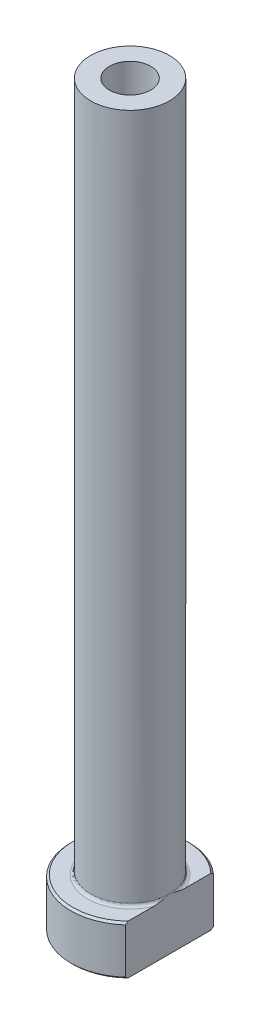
ISO-10303-21;
HEADER;
FILE_DESCRIPTION(('STEP AP214'),'2;1');
FILE_NAME('part.step','',(''),(''),'','','');
FILE_SCHEMA(('AUTOMOTIVE_DESIGN { 1 0 10303 214 1 1 1 1 }'));
ENDSEC;
DATA;
#1=APPLICATION_CONTEXT('core data for automotive mechanical design processes');
#2=APPLICATION_PROTOCOL_DEFINITION('international standard','automotive_design',2000,#1);
#3=PRODUCT_CONTEXT('',#1,'mechanical');
#4=PRODUCT('Part','Part','',(#3));
#5=PRODUCT_RELATED_PRODUCT_CATEGORY('part','',(#4));
#6=PRODUCT_DEFINITION_FORMATION('','',#4);
#7=PRODUCT_DEFINITION_CONTEXT('part definition',#1,'design');
#8=PRODUCT_DEFINITION('design','',#6,#7);
#9=PRODUCT_DEFINITION_SHAPE('','',#8);
#10=(LENGTH_UNIT() NAMED_UNIT(*) SI_UNIT(.MILLI.,.METRE.));
#11=(NAMED_UNIT(*) PLANE_ANGLE_UNIT() SI_UNIT($,.RADIAN.));
#12=(NAMED_UNIT(*) SI_UNIT($,.STERADIAN.) SOLID_ANGLE_UNIT());
#13=UNCERTAINTY_MEASURE_WITH_UNIT(LENGTH_MEASURE(1.E-05),#10,'distance_accuracy_value','');
#14=(GEOMETRIC_REPRESENTATION_CONTEXT(3) GLOBAL_UNCERTAINTY_ASSIGNED_CONTEXT((#13)) GLOBAL_UNIT_ASSIGNED_CONTEXT((#10,
#11,#12)) REPRESENTATION_CONTEXT('',''));
#15=CARTESIAN_POINT('',(0.,0.,0.));
#16=DIRECTION('',(0.,0.,1.));
#17=DIRECTION('',(1.,0.,0.));
#18=AXIS2_PLACEMENT_3D('',#15,#16,#17);
#19=CARTESIAN_POINT('',(0.,92.1876809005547,0.));
#20=DIRECTION('',(0.,1.,0.));
#21=DIRECTION('',(0.,0.,1.));
#22=AXIS2_PLACEMENT_3D('',#19,#20,#21);
#23=CYLINDRICAL_SURFACE('',#22,2.10000000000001);
#24=CARTESIAN_POINT('',(0.,75.,0.));
#25=DIRECTION('',(0.,1.,0.));
#26=DIRECTION('',(0.,0.,1.));
#27=AXIS2_PLACEMENT_3D('',#24,#25,#26);
#28=CIRCLE('',#27,2.10000000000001);
#29=CARTESIAN_POINT('',(0.,75.,2.10000000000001));
#30=VERTEX_POINT('',#29);
#31=EDGE_CURVE('E167',#30,#30,#28,.T.);
#32=ORIENTED_EDGE('',*,*,#31,.T.);
#33=EDGE_LOOP('',(#32));
#34=FACE_BOUND('',#33,.T.);
#35=CARTESIAN_POINT('',(0.,30.,0.));
#36=DIRECTION('',(0.,1.,0.));
#37=DIRECTION('',(0.,0.,1.));
#38=AXIS2_PLACEMENT_3D('',#35,#36,#37);
#39=CIRCLE('',#38,2.10000000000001);
#40=CARTESIAN_POINT('',(0.,30.,2.10000000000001));
#41=VERTEX_POINT('',#40);
#42=EDGE_CURVE('E170',#41,#41,#39,.T.);
#43=ORIENTED_EDGE('',*,*,#42,.F.);
#44=EDGE_LOOP('',(#43));
#45=FACE_BOUND('',#44,.T.);
#46=ADVANCED_FACE('F32',(#34,#45),#23,.F.);
#47=CARTESIAN_POINT('',(-2.10000000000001,75.,0.));
#48=DIRECTION('',(0.,1.,0.));
#49=DIRECTION('',(0.,0.,1.));
#50=AXIS2_PLACEMENT_3D('',#47,#48,#49);
#51=PLANE('',#50);
#52=CARTESIAN_POINT('',(0.,75.,0.));
#53=DIRECTION('',(0.,1.,0.));
#54=DIRECTION('',(0.,0.,1.));
#55=AXIS2_PLACEMENT_3D('',#52,#53,#54);
#56=CIRCLE('',#55,4.);
#57=CARTESIAN_POINT('',(0.,75.,4.));
#58=VERTEX_POINT('',#57);
#59=EDGE_CURVE('E174',#58,#58,#56,.T.);
#60=ORIENTED_EDGE('',*,*,#59,.T.);
#61=EDGE_LOOP('',(#60));
#62=FACE_BOUND('',#61,.T.);
#63=ORIENTED_EDGE('',*,*,#31,.F.);
#64=EDGE_LOOP('',(#63));
#65=FACE_BOUND('',#64,.T.);
#66=ADVANCED_FACE('F157',(#62,#65),#51,.T.);
#67=CARTESIAN_POINT('',(0.,92.1876809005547,0.));
#68=DIRECTION('',(0.,1.,0.));
#69=DIRECTION('',(0.,0.,1.));
#70=AXIS2_PLACEMENT_3D('',#67,#68,#69);
#71=CYLINDRICAL_SURFACE('',#70,3.99999999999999);
#72=CARTESIAN_POINT('',(0.,5.3,0.));
#73=DIRECTION('',(0.,1.,0.));
#74=DIRECTION('',(0.,0.,1.));
#75=AXIS2_PLACEMENT_3D('',#72,#73,#74);
#76=CIRCLE('',#75,3.99999999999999);
#77=CARTESIAN_POINT('',(4.,5.3,0.));
#78=VERTEX_POINT('',#77);
#79=EDGE_CURVE('E180',#78,#78,#76,.T.);
#80=ORIENTED_EDGE('',*,*,#79,.T.);
#81=EDGE_LOOP('',(#80));
#82=FACE_BOUND('',#81,.T.);
#83=ORIENTED_EDGE('',*,*,#59,.F.);
#84=EDGE_LOOP('',(#83));
#85=FACE_BOUND('',#84,.T.);
#86=ADVANCED_FACE('F162',(#82,#85),#71,.T.);
#87=CARTESIAN_POINT('',(-3.99999999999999,5.,0.));
#88=DIRECTION('',(0.,1.,0.));
#89=DIRECTION('',(0.,0.,1.));
#90=AXIS2_PLACEMENT_3D('',#87,#88,#89);
#91=PLANE('',#90);
#92=DIRECTION('',(0.,0.,1.));
#93=VECTOR('',#92,1.);
#94=CARTESIAN_POINT('',(4.,5.,0.));
#95=LINE('',#94,#93);
#96=CARTESIAN_POINT('',(4.,5.,-4.19999999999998));
#97=VERTEX_POINT('',#96);
#98=CARTESIAN_POINT('',(4.,5.,-1.57797338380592));
#99=VERTEX_POINT('',#98);
#100=EDGE_CURVE('E54',#97,#99,#95,.T.);
#101=ORIENTED_EDGE('',*,*,#100,.F.);
#102=CARTESIAN_POINT('',(0.,5.,0.));
#103=DIRECTION('',(0.,1.,0.));
#104=DIRECTION('',(0.,0.,1.));
#105=AXIS2_PLACEMENT_3D('',#102,#103,#104);
#106=CIRCLE('',#105,5.79999999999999);
#107=CARTESIAN_POINT('',(4.,5.,4.19999999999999));
#108=VERTEX_POINT('',#107);
#109=EDGE_CURVE('E186',#97,#108,#106,.T.);
#110=ORIENTED_EDGE('',*,*,#109,.T.);
#111=CARTESIAN_POINT('',(4.,5.,1.57797338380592));
#112=VERTEX_POINT('',#111);
#113=EDGE_CURVE('E134',#112,#108,#95,.T.);
#114=ORIENTED_EDGE('',*,*,#113,.F.);
#115=CARTESIAN_POINT('',(0.,5.,0.));
#116=DIRECTION('',(0.,1.,0.));
#117=DIRECTION('',(0.,0.,1.));
#118=AXIS2_PLACEMENT_3D('',#115,#116,#117);
#119=CIRCLE('',#118,4.29999999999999);
#120=EDGE_CURVE('E183',#112,#99,#119,.F.);
#121=ORIENTED_EDGE('',*,*,#120,.T.);
#122=EDGE_LOOP('',(#101,#110,#114,#121));
#123=FACE_BOUND('',#122,.T.);
#124=ADVANCED_FACE('F197',(#123),#91,.T.);
#125=CARTESIAN_POINT('',(0.,92.1876809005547,0.));
#126=DIRECTION('',(0.,1.,0.));
#127=DIRECTION('',(0.,0.,1.));
#128=AXIS2_PLACEMENT_3D('',#125,#126,#127);
#129=CYLINDRICAL_SURFACE('',#128,5.99999999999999);
#130=DIRECTION('',(0.,-1.,0.));
#131=VECTOR('',#130,1.);
#132=CARTESIAN_POINT('',(4.,75.,4.47213595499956));
#133=LINE('',#132,#131);
#134=CARTESIAN_POINT('',(4.,4.8,4.47213595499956));
#135=VERTEX_POINT('',#134);
#136=CARTESIAN_POINT('',(4.,0.20000000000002,4.47213595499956));
#137=VERTEX_POINT('',#136);
#138=EDGE_CURVE('E82',#135,#137,#133,.T.);
#139=ORIENTED_EDGE('',*,*,#138,.F.);
#140=CARTESIAN_POINT('',(0.,4.8,0.));
#141=DIRECTION('',(0.,1.,0.));
#142=DIRECTION('',(0.,0.,1.));
#143=AXIS2_PLACEMENT_3D('',#140,#141,#142);
#144=CIRCLE('',#143,5.99999999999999);
#145=CARTESIAN_POINT('',(4.,4.8,-4.47213595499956));
#146=VERTEX_POINT('',#145);
#147=EDGE_CURVE('E95',#135,#146,#144,.F.);
#148=ORIENTED_EDGE('',*,*,#147,.T.);
#149=DIRECTION('',(0.,-1.,0.));
#150=VECTOR('',#149,1.);
#151=CARTESIAN_POINT('',(4.,75.,-4.47213595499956));
#152=LINE('',#151,#150);
#153=CARTESIAN_POINT('',(4.,0.20000000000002,-4.47213595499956));
#154=VERTEX_POINT('',#153);
#155=EDGE_CURVE('E192',#146,#154,#152,.T.);
#156=ORIENTED_EDGE('',*,*,#155,.T.);
#157=CARTESIAN_POINT('',(0.,0.20000000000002,0.));
#158=DIRECTION('',(0.,-1.,0.));
#159=DIRECTION('',(0.,0.,-1.));
#160=AXIS2_PLACEMENT_3D('',#157,#158,#159);
#161=CIRCLE('',#160,5.99999999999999);
#162=EDGE_CURVE('E98',#154,#137,#161,.F.);
#163=ORIENTED_EDGE('',*,*,#162,.T.);
#164=EDGE_LOOP('',(#139,#148,#156,#163));
#165=FACE_BOUND('',#164,.T.);
#166=ADVANCED_FACE('F190',(#165),#129,.T.);
#167=CARTESIAN_POINT('',(-5.99999999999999,0.,0.));
#168=DIRECTION('',(0.,-1.,0.));
#169=DIRECTION('',(0.,0.,-1.));
#170=AXIS2_PLACEMENT_3D('',#167,#168,#169);
#171=PLANE('',#170);
#172=CARTESIAN_POINT('',(0.,0.,0.));
#173=DIRECTION('',(0.,-1.,0.));
#174=DIRECTION('',(0.,0.,-1.));
#175=AXIS2_PLACEMENT_3D('',#172,#173,#174);
#176=CIRCLE('',#175,2.84999999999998);
#177=CARTESIAN_POINT('',(0.,0.,-2.84999999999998));
#178=VERTEX_POINT('',#177);
#179=EDGE_CURVE('E40',#178,#178,#176,.F.);
#180=ORIENTED_EDGE('',*,*,#179,.T.);
#181=EDGE_LOOP('',(#180));
#182=FACE_BOUND('',#181,.T.);
#183=DIRECTION('',(0.,0.,-1.));
#184=VECTOR('',#183,1.);
#185=CARTESIAN_POINT('',(4.,0.,4.47213595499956));
#186=LINE('',#185,#184);
#187=CARTESIAN_POINT('',(4.,0.,4.19999999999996));
#188=VERTEX_POINT('',#187);
#189=CARTESIAN_POINT('',(4.,0.,-4.19999999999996));
#190=VERTEX_POINT('',#189);
#191=EDGE_CURVE('E47',#188,#190,#186,.T.);
#192=ORIENTED_EDGE('',*,*,#191,.F.);
#193=CARTESIAN_POINT('',(0.,0.,0.));
#194=DIRECTION('',(0.,-1.,0.));
#195=DIRECTION('',(0.,0.,-1.));
#196=AXIS2_PLACEMENT_3D('',#193,#194,#195);
#197=CIRCLE('',#196,5.79999999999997);
#198=EDGE_CURVE('E92',#188,#190,#197,.T.);
#199=ORIENTED_EDGE('',*,*,#198,.T.);
#200=EDGE_LOOP('',(#192,#199));
#201=FACE_BOUND('',#200,.T.);
#202=ADVANCED_FACE('F91',(#182,#201),#171,.T.);
#203=CARTESIAN_POINT('',(0.,92.1876809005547,0.));
#204=DIRECTION('',(0.,1.,0.));
#205=DIRECTION('',(0.,0.,1.));
#206=AXIS2_PLACEMENT_3D('',#203,#204,#205);
#207=CYLINDRICAL_SURFACE('',#206,2.34999999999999);
#208=CARTESIAN_POINT('',(0.,0.499999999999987,0.));
#209=DIRECTION('',(0.,-1.,0.));
#210=DIRECTION('',(0.,0.,-1.));
#211=AXIS2_PLACEMENT_3D('',#208,#209,#210);
#212=CIRCLE('',#211,2.34999999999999);
#213=CARTESIAN_POINT('',(0.,0.499999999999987,-2.34999999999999));
#214=VERTEX_POINT('',#213);
#215=EDGE_CURVE('E11',#214,#214,#212,.T.);
#216=ORIENTED_EDGE('',*,*,#215,.T.);
#217=EDGE_LOOP('',(#216));
#218=FACE_BOUND('',#217,.T.);
#219=CARTESIAN_POINT('',(0.,18.,0.));
#220=DIRECTION('',(0.,1.,0.));
#221=DIRECTION('',(0.,0.,1.));
#222=AXIS2_PLACEMENT_3D('',#219,#220,#221);
#223=CIRCLE('',#222,2.34999999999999);
#224=CARTESIAN_POINT('',(0.,18.,2.34999999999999));
#225=VERTEX_POINT('',#224);
#226=EDGE_CURVE('E172',#225,#225,#223,.T.);
#227=ORIENTED_EDGE('',*,*,#226,.T.);
#228=EDGE_LOOP('',(#227));
#229=FACE_BOUND('',#228,.T.);
#230=ADVANCED_FACE('F215',(#218,#229),#207,.F.);
#231=CARTESIAN_POINT('',(0.,18.,0.));
#232=DIRECTION('',(0.,-1.,0.));
#233=DIRECTION('',(0.,0.,-1.));
#234=AXIS2_PLACEMENT_3D('',#231,#232,#233);
#235=CONICAL_SURFACE('',#234,2.34999999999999,0.0208303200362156);
#236=ORIENTED_EDGE('',*,*,#42,.T.);
#237=EDGE_LOOP('',(#236));
#238=FACE_BOUND('',#237,.T.);
#239=ORIENTED_EDGE('',*,*,#226,.F.);
#240=EDGE_LOOP('',(#239));
#241=FACE_BOUND('',#240,.T.);
#242=ADVANCED_FACE('F111',(#238,#241),#235,.F.);
#243=CARTESIAN_POINT('',(0.,5.3,0.));
#244=DIRECTION('',(0.,1.,0.));
#245=DIRECTION('',(0.,0.,1.));
#246=AXIS2_PLACEMENT_3D('',#243,#244,#245);
#247=TOROIDAL_SURFACE('',#246,4.29999999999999,0.3);
#248=ORIENTED_EDGE('',*,*,#120,.F.);
#249=CARTESIAN_POINT('',(4.,5.3,0.));
#250=CARTESIAN_POINT('',(4.,5.30000062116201,-1.06261555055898E-10));
#251=CARTESIAN_POINT('',(4.,5.30000124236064,2.17725865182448E-07));
#252=CARTESIAN_POINT('',(4.,5.30000240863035,8.36140563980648E-07));
#253=CARTESIAN_POINT('',(4.,5.30000294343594,1.25011629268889E-06));
#254=CARTESIAN_POINT('',(4.,5.30000404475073,2.23959264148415E-06));
#255=CARTESIAN_POINT('',(4.,5.30000459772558,2.83084373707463E-06));
#256=CARTESIAN_POINT('',(4.,5.30000559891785,4.06516501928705E-06));
#257=CARTESIAN_POINT('',(4.,5.30000604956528,4.70639984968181E-06));
#258=CARTESIAN_POINT('',(4.,5.30000769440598,7.15677047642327E-06));
#259=CARTESIAN_POINT('',(4.,5.30000879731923,9.02995771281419E-06));
#260=CARTESIAN_POINT('',(4.,5.30001063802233,1.27664864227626E-05));
#261=CARTESIAN_POINT('',(4.,5.3000113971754,1.46197785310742E-05));
#262=CARTESIAN_POINT('',(4.,5.30001453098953,2.2367918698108E-05));
#263=CARTESIAN_POINT('',(4.,5.30001683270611,2.8296870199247E-05));
#264=CARTESIAN_POINT('',(4.,5.30002027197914,3.9566867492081E-05));
#265=CARTESIAN_POINT('',(4.,5.30002152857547,4.48715411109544E-05));
#266=CARTESIAN_POINT('',(4.,5.30003060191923,8.40118119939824E-05));
#267=CARTESIAN_POINT('',(4.,5.30003739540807,0.000118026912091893));
#268=CARTESIAN_POINT('',(4.,5.30006713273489,0.000252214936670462));
#269=CARTESIAN_POINT('',(4.,5.30009559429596,0.000351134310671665));
#270=CARTESIAN_POINT('',(4.,5.30020622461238,0.000742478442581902));
#271=CARTESIAN_POINT('',(4.,5.30028475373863,0.00103561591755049));
#272=CARTESIAN_POINT('',(4.,5.30059889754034,0.00219920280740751));
#273=CARTESIAN_POINT('',(4.,5.30083905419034,0.00306873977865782));
#274=CARTESIAN_POINT('',(4.00000000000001,5.30183682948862,0.00669141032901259));
#275=CARTESIAN_POINT('',(4.,5.30258877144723,0.0094456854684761));
#276=CARTESIAN_POINT('',(3.99999999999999,5.31066890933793,0.0390293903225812));
#277=CARTESIAN_POINT('',(4.,5.31802631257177,0.0658531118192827));
#278=CARTESIAN_POINT('',(4.00000000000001,5.33239676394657,0.118441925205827));
#279=CARTESIAN_POINT('',(4.,5.33941183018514,0.144206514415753));
#280=CARTESIAN_POINT('',(4.,5.35427366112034,0.199017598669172));
#281=CARTESIAN_POINT('',(4.,5.36211313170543,0.228066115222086));
#282=CARTESIAN_POINT('',(4.,5.37776349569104,0.286511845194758));
#283=CARTESIAN_POINT('',(4.,5.38557313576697,0.315909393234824));
#284=CARTESIAN_POINT('',(4.,5.40425662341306,0.386994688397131));
#285=CARTESIAN_POINT('',(4.,5.4150523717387,0.428703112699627));
#286=CARTESIAN_POINT('',(4.,5.43592310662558,0.511098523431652));
#287=CARTESIAN_POINT('',(4.,5.44600969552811,0.551782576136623));
#288=CARTESIAN_POINT('',(4.,5.47850986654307,0.686599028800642));
#289=CARTESIAN_POINT('',(4.,5.49978370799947,0.781011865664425));
#290=CARTESIAN_POINT('',(4.,5.53807543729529,0.97184761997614));
#291=CARTESIAN_POINT('',(4.,5.55504273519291,1.06828120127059));
#292=CARTESIAN_POINT('',(4.,5.5758240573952,1.21752725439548));
#293=CARTESIAN_POINT('',(4.,5.58209796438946,1.26999379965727));
#294=CARTESIAN_POINT('',(4.,5.59210686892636,1.37516324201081));
#295=CARTESIAN_POINT('',(4.,5.59584265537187,1.4278660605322));
#296=CARTESIAN_POINT('',(4.,5.60010438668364,1.53310673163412));
#297=CARTESIAN_POINT('',(4.,5.6006487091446,1.58564378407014));
#298=CARTESIAN_POINT('',(4.,5.59767158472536,1.69058605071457));
#299=CARTESIAN_POINT('',(4.,5.5941550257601,1.74299134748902));
#300=CARTESIAN_POINT('',(4.,5.58503062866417,1.8190329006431));
#301=CARTESIAN_POINT('',(4.,5.58157617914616,1.84292934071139));
#302=CARTESIAN_POINT('',(4.,5.57329952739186,1.89051061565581));
#303=CARTESIAN_POINT('',(4.,5.56847619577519,1.91419525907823));
#304=CARTESIAN_POINT('',(4.,5.55726644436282,1.96092888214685));
#305=CARTESIAN_POINT('',(4.,5.55089740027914,1.98398195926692));
#306=CARTESIAN_POINT('',(4.,5.53623434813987,2.02945550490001));
#307=CARTESIAN_POINT('',(4.,5.52794253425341,2.0518766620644));
#308=CARTESIAN_POINT('',(4.,5.5088709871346,2.09590631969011));
#309=CARTESIAN_POINT('',(4.,5.49806837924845,2.11750508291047));
#310=CARTESIAN_POINT('',(4.,5.4733340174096,2.15885583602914));
#311=CARTESIAN_POINT('',(4.,5.45941272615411,2.17861369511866));
#312=CARTESIAN_POINT('',(4.,5.43588221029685,2.20522942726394));
#313=CARTESIAN_POINT('',(4.,5.42781139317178,2.21344043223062));
#314=CARTESIAN_POINT('',(4.,5.4106511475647,2.22875149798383));
#315=CARTESIAN_POINT('',(4.,5.40156129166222,2.23585108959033));
#316=CARTESIAN_POINT('',(4.,5.38220524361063,2.24859694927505));
#317=CARTESIAN_POINT('',(4.,5.37192420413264,2.25422119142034));
#318=CARTESIAN_POINT('',(4.,5.35045072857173,2.26331064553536));
#319=CARTESIAN_POINT('',(4.,5.3392612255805,2.2667825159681));
#320=CARTESIAN_POINT('',(4.,5.31952044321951,2.27051268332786));
#321=CARTESIAN_POINT('',(4.,5.31108453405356,2.2713901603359));
#322=CARTESIAN_POINT('',(4.,5.29418624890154,2.27168963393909));
#323=CARTESIAN_POINT('',(4.,5.28572387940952,2.27111196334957));
#324=CARTESIAN_POINT('',(4.,5.26904138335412,2.26855580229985));
#325=CARTESIAN_POINT('',(4.,5.2608206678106,2.26658107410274));
#326=CARTESIAN_POINT('',(4.,5.2447821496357,2.26139496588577));
#327=CARTESIAN_POINT('',(4.,5.23696461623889,2.25818277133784));
#328=CARTESIAN_POINT('',(4.,5.21851235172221,2.24908332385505));
#329=CARTESIAN_POINT('',(4.,5.20815219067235,2.24264095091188));
#330=CARTESIAN_POINT('',(4.,5.1885797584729,2.22819957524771));
#331=CARTESIAN_POINT('',(4.,5.17937061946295,2.22019647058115));
#332=CARTESIAN_POINT('',(4.,5.15665383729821,2.19777756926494));
#333=CARTESIAN_POINT('',(4.,5.1440348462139,2.18246908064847));
#334=CARTESIAN_POINT('',(4.,5.12118369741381,2.15020843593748));
#335=CARTESIAN_POINT('',(4.,5.11095480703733,2.13325407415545));
#336=CARTESIAN_POINT('',(4.,5.09273574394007,2.0989232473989));
#337=CARTESIAN_POINT('',(4.,5.08468212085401,2.08157988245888));
#338=CARTESIAN_POINT('',(4.,5.070059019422,2.04627072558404));
#339=CARTESIAN_POINT('',(4.,5.06349101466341,2.02830433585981));
#340=CARTESIAN_POINT('',(4.,5.04555485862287,1.97350761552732));
#341=CARTESIAN_POINT('',(4.,5.03608974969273,1.93605770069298));
#342=CARTESIAN_POINT('',(4.,5.01780569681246,1.84529235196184));
#343=CARTESIAN_POINT('',(4.,5.01077018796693,1.79164082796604));
#344=CARTESIAN_POINT('',(4.,5.00182846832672,1.68379947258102));
#345=CARTESIAN_POINT('',(4.,4.99993887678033,1.62960846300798));
#346=CARTESIAN_POINT('',(4.,5.00006129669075,1.52361204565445));
#347=CARTESIAN_POINT('',(4.,5.00190698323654,1.4718055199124));
#348=CARTESIAN_POINT('',(4.,5.00841243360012,1.36835357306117));
#349=CARTESIAN_POINT('',(4.,5.01307376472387,1.31670825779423));
#350=CARTESIAN_POINT('',(4.,5.02905484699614,1.17431887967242));
#351=CARTESIAN_POINT('',(4.,5.04274090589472,1.08384207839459));
#352=CARTESIAN_POINT('',(4.,5.06701714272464,0.947757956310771));
#353=CARTESIAN_POINT('',(4.,5.07585573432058,0.901814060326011));
#354=CARTESIAN_POINT('',(4.,5.09458665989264,0.810008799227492));
#355=CARTESIAN_POINT('',(4.,5.10448180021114,0.764148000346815));
#356=CARTESIAN_POINT('',(4.,5.12892434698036,0.655631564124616));
#357=CARTESIAN_POINT('',(4.,5.1438355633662,0.593058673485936));
#358=CARTESIAN_POINT('',(4.,5.17458762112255,0.468885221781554));
#359=CARTESIAN_POINT('',(4.,5.19041623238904,0.407281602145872));
#360=CARTESIAN_POINT('',(4.00000000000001,5.22090834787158,0.29123270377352));
#361=CARTESIAN_POINT('',(4.00000000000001,5.23550024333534,0.236768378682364));
#362=CARTESIAN_POINT('',(3.99999999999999,5.26562550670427,0.12560406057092));
#363=CARTESIAN_POINT('',(3.99999999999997,5.28117250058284,0.0689076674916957));
#364=CARTESIAN_POINT('',(4.,5.29741226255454,0.00944154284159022));
#365=CARTESIAN_POINT('',(4.00000000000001,5.29816540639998,0.0066831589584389));
#366=CARTESIAN_POINT('',(4.,5.29916346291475,0.00305954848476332));
#367=CARTESIAN_POINT('',(4.,5.29940273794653,0.00219318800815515));
#368=CARTESIAN_POINT('',(4.,5.29971580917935,0.00103357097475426));
#369=CARTESIAN_POINT('',(4.,5.29979412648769,0.000741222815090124));
#370=CARTESIAN_POINT('',(4.,5.29990450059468,0.000350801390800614));
#371=CARTESIAN_POINT('',(4.,5.29993292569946,0.000252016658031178));
#372=CARTESIAN_POINT('',(4.,5.299962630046,0.000117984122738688));
#373=CARTESIAN_POINT('',(4.,5.29996941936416,8.39881812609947E-05));
#374=CARTESIAN_POINT('',(4.,5.29997848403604,4.48673961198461E-05));
#375=CARTESIAN_POINT('',(4.,5.29997973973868,3.956381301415E-05));
#376=CARTESIAN_POINT('',(4.,5.29998317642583,2.82960286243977E-05));
#377=CARTESIAN_POINT('',(4.,5.29998547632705,2.23681417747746E-05));
#378=CARTESIAN_POINT('',(4.,5.29998860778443,1.46210978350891E-05));
#379=CARTESIAN_POINT('',(4.,5.29998936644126,1.2767887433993E-05));
#380=CARTESIAN_POINT('',(4.,5.29999120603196,9.03143823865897E-06));
#381=CARTESIAN_POINT('',(4.,5.29999230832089,7.15823907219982E-06));
#382=CARTESIAN_POINT('',(4.,5.2999939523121,4.70775413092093E-06));
#383=CARTESIAN_POINT('',(4.,5.29999440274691,4.06646272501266E-06));
#384=CARTESIAN_POINT('',(4.,5.29999540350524,2.83198991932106E-06));
#385=CARTESIAN_POINT('',(4.,5.2999959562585,2.24064265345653E-06));
#386=CARTESIAN_POINT('',(4.,5.29999705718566,1.25093918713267E-06));
#387=CARTESIAN_POINT('',(4.,5.29999759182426,8.36840620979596E-07));
#388=CARTESIAN_POINT('',(4.,5.29999875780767,2.18117547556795E-07));
#389=CARTESIAN_POINT('',(4.,5.29999937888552,1.06254975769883E-10));
#390=CARTESIAN_POINT('',(4.,5.3,0.));
#391=B_SPLINE_CURVE_WITH_KNOTS('',3,(#249,#250,#251,#252,#253,#254,#255,#256,#257,#258,#259,
#260,#261,#262,#263,#264,#265,#266,#267,#268,#269,#270,#271,#272,#273,#274,#275,#276,#277,#278,
#279,#280,#281,#282,#283,#284,#285,#286,#287,#288,#289,#290,#291,#292,#293,#294,#295,#296,#297,
#298,#299,#300,#301,#302,#303,#304,#305,#306,#307,#308,#309,#310,#311,#312,#313,#314,#315,#316,
#317,#318,#319,#320,#321,#322,#323,#324,#325,#326,#327,#328,#329,#330,#331,#332,#333,#334,#335,
#336,#337,#338,#339,#340,#341,#342,#343,#344,#345,#346,#347,#348,#349,#350,#351,#352,#353,#354,
#355,#356,#357,#358,#359,#360,#361,#362,#363,#364,#365,#366,#367,#368,#369,#370,#371,#372,#373,
#374,#375,#376,#377,#378,#379,#380,#381,#382,#383,#384,#385,#386,#387,#388,#389,#390),
.UNSPECIFIED.,.T.,.F.,(4,2,2,2,2,2,2,2,2,2,2,2,2,2,2,2,2,2,2,2,2,2,2,2,2,2,2,2,2,2,2,2,2,2,2,2,
2,2,2,2,2,2,2,2,2,2,2,2,2,2,2,2,2,2,2,2,2,2,2,2,2,2,2,2,2,2,2,2,2,2,4),(0.,1.87484697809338E-06,
3.90180538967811E-06,6.31684510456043E-06,8.66652831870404E-06,1.51627653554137E-05,
2.11658058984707E-05,4.02090897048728E-05,5.65429629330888E-05,0.000160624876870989,
0.000469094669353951,0.00137985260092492,0.00408571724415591,0.0126514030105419,
0.0960918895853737,0.176200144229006,0.266463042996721,0.357714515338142,0.486961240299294,
0.612707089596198,0.902988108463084,1.1965358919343,1.35501075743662,1.51343634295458,
1.67094875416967,1.82827177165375,1.9006759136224,1.97313996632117,2.04482437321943,
2.11642737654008,2.18871023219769,2.26075412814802,2.29521947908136,2.32969934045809,
2.3646679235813,2.39952778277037,2.42485422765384,2.45017488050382,2.47542760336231,
2.50069697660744,2.53708899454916,2.57357798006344,2.63276032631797,2.69202310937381,
2.74930315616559,2.80663977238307,2.92223125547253,3.084207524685,3.24670629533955,
3.40212850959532,3.55763731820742,3.83192962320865,3.97228382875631,4.11302057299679,
4.30598130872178,4.49678885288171,4.66594443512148,4.8423060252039,4.85088453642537,
4.85358051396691,4.85448881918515,4.85479687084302,4.85490089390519,4.85491722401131,
4.85493626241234,4.85494226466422,4.85494875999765,4.85495110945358,4.85495352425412,
4.85495555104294,4.85495742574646),.UNSPECIFIED.);
#392=EDGE_CURVE('E126',#112,#78,#391,.T.);
#393=ORIENTED_EDGE('',*,*,#392,.T.);
#394=ORIENTED_EDGE('',*,*,#79,.F.);
#395=CARTESIAN_POINT('',(4.,5.3,0.));
#396=CARTESIAN_POINT('',(4.,5.29999937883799,1.06262883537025E-10));
#397=CARTESIAN_POINT('',(4.,5.29999875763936,-2.17725863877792E-07));
#398=CARTESIAN_POINT('',(4.,5.29999759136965,-8.36140562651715E-07));
#399=CARTESIAN_POINT('',(4.,5.29999705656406,-1.25011629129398E-06));
#400=CARTESIAN_POINT('',(4.,5.29999595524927,-2.2395926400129E-06));
#401=CARTESIAN_POINT('',(4.,5.29999540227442,-2.83084373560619E-06));
#402=CARTESIAN_POINT('',(4.,5.29999440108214,-4.06516501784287E-06));
#403=CARTESIAN_POINT('',(4.,5.29999395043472,-4.70639984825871E-06));
#404=CARTESIAN_POINT('',(4.,5.29999230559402,-7.15677047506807E-06));
#405=CARTESIAN_POINT('',(4.,5.29999120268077,-9.02995771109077E-06));
#406=CARTESIAN_POINT('',(4.,5.29998936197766,-1.27664864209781E-05));
#407=CARTESIAN_POINT('',(4.,5.29998860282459,-1.46197785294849E-05));
#408=CARTESIAN_POINT('',(4.,5.29998546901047,-2.23679186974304E-05));
#409=CARTESIAN_POINT('',(4.,5.29998316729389,-2.82968701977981E-05));
#410=CARTESIAN_POINT('',(4.,5.29997972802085,-3.95668674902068E-05));
#411=CARTESIAN_POINT('',(4.,5.29997847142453,-4.48715411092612E-05));
#412=CARTESIAN_POINT('',(4.,5.29996939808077,-8.40118119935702E-05));
#413=CARTESIAN_POINT('',(4.,5.29996260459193,-0.000118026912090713));
#414=CARTESIAN_POINT('',(4.,5.2999328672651,-0.000252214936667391));
#415=CARTESIAN_POINT('',(4.,5.29990440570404,-0.000351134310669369));
#416=CARTESIAN_POINT('',(4.,5.29979377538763,-0.000742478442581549));
#417=CARTESIAN_POINT('',(4.,5.29971524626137,-0.00103561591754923));
#418=CARTESIAN_POINT('',(4.,5.29940110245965,-0.0021992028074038));
#419=CARTESIAN_POINT('',(4.,5.29916094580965,-0.00306873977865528));
#420=CARTESIAN_POINT('',(4.00000000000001,5.29816317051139,-0.00669141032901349));
#421=CARTESIAN_POINT('',(4.,5.29741122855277,-0.00944568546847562));
#422=CARTESIAN_POINT('',(3.99999999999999,5.28933109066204,-0.0390293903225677));
#423=CARTESIAN_POINT('',(4.,5.28197368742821,-0.0658531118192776));
#424=CARTESIAN_POINT('',(4.00000000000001,5.26760323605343,-0.118441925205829));
#425=CARTESIAN_POINT('',(4.,5.26058816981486,-0.144206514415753));
#426=CARTESIAN_POINT('',(4.,5.24572633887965,-0.199017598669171));
#427=CARTESIAN_POINT('',(4.,5.23788686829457,-0.228066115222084));
#428=CARTESIAN_POINT('',(4.,5.22223650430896,-0.286511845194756));
#429=CARTESIAN_POINT('',(4.,5.21442686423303,-0.315909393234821));
#430=CARTESIAN_POINT('',(4.,5.19574337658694,-0.386994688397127));
#431=CARTESIAN_POINT('',(4.,5.18494762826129,-0.428703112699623));
#432=CARTESIAN_POINT('',(4.,5.16407689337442,-0.511098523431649));
#433=CARTESIAN_POINT('',(4.,5.15399030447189,-0.551782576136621));
#434=CARTESIAN_POINT('',(4.,5.12149013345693,-0.686599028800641));
#435=CARTESIAN_POINT('',(4.,5.10021629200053,-0.781011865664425));
#436=CARTESIAN_POINT('',(4.,5.06192456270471,-0.97184761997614));
#437=CARTESIAN_POINT('',(4.,5.04495726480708,-1.06828120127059));
#438=CARTESIAN_POINT('',(4.,5.02417594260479,-1.21752725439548));
#439=CARTESIAN_POINT('',(4.,5.01790203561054,-1.26999379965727));
#440=CARTESIAN_POINT('',(4.,5.00789313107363,-1.37516324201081));
#441=CARTESIAN_POINT('',(4.,5.00415734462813,-1.42786606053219));
#442=CARTESIAN_POINT('',(4.,4.99989561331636,-1.53310673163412));
#443=CARTESIAN_POINT('',(4.,4.9993512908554,-1.58564378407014));
#444=CARTESIAN_POINT('',(4.,5.00232841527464,-1.69058605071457));
#445=CARTESIAN_POINT('',(4.,5.0058449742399,-1.74299134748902));
#446=CARTESIAN_POINT('',(4.,5.01496937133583,-1.8190329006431));
#447=CARTESIAN_POINT('',(4.,5.01842382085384,-1.84292934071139));
#448=CARTESIAN_POINT('',(4.,5.02670047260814,-1.89051061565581));
#449=CARTESIAN_POINT('',(4.,5.03152380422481,-1.91419525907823));
#450=CARTESIAN_POINT('',(4.,5.04273355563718,-1.96092888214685));
#451=CARTESIAN_POINT('',(4.,5.04910259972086,-1.98398195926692));
#452=CARTESIAN_POINT('',(4.,5.06376565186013,-2.02945550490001));
#453=CARTESIAN_POINT('',(4.,5.07205746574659,-2.0518766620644));
#454=CARTESIAN_POINT('',(4.,5.0911290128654,-2.09590631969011));
#455=CARTESIAN_POINT('',(4.,5.10193162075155,-2.11750508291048));
#456=CARTESIAN_POINT('',(4.,5.1266659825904,-2.15885583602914));
#457=CARTESIAN_POINT('',(4.,5.14058727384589,-2.17861369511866));
#458=CARTESIAN_POINT('',(4.,5.16411778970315,-2.20522942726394));
#459=CARTESIAN_POINT('',(4.,5.17218860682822,-2.21344043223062));
#460=CARTESIAN_POINT('',(4.,5.1893488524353,-2.22875149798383));
#461=CARTESIAN_POINT('',(4.,5.19843870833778,-2.23585108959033));
#462=CARTESIAN_POINT('',(4.,5.21779475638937,-2.24859694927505));
#463=CARTESIAN_POINT('',(4.,5.22807579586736,-2.25422119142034));
#464=CARTESIAN_POINT('',(4.,5.24954927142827,-2.26331064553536));
#465=CARTESIAN_POINT('',(4.,5.2607387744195,-2.2667825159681));
#466=CARTESIAN_POINT('',(4.,5.28047955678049,-2.27051268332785));
#467=CARTESIAN_POINT('',(4.,5.28891546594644,-2.27139016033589));
#468=CARTESIAN_POINT('',(4.,5.30581375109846,-2.27168963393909));
#469=CARTESIAN_POINT('',(4.,5.31427612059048,-2.27111196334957));
#470=CARTESIAN_POINT('',(4.,5.33095861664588,-2.26855580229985));
#471=CARTESIAN_POINT('',(4.,5.3391793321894,-2.26658107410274));
#472=CARTESIAN_POINT('',(4.,5.3552178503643,-2.26139496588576));
#473=CARTESIAN_POINT('',(4.,5.3630353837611,-2.25818277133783));
#474=CARTESIAN_POINT('',(4.,5.38148764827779,-2.24908332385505));
#475=CARTESIAN_POINT('',(4.,5.39184780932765,-2.24264095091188));
#476=CARTESIAN_POINT('',(4.,5.4114202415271,-2.22819957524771));
#477=CARTESIAN_POINT('',(4.,5.42062938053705,-2.22019647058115));
#478=CARTESIAN_POINT('',(4.,5.44334616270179,-2.19777756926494));
#479=CARTESIAN_POINT('',(4.,5.4559651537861,-2.18246908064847));
#480=CARTESIAN_POINT('',(4.,5.47881630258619,-2.15020843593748));
#481=CARTESIAN_POINT('',(4.,5.48904519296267,-2.13325407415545));
#482=CARTESIAN_POINT('',(4.,5.50726425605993,-2.09892324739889));
#483=CARTESIAN_POINT('',(4.,5.515317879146,-2.08157988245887));
#484=CARTESIAN_POINT('',(4.,5.529940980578,-2.04627072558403));
#485=CARTESIAN_POINT('',(4.,5.53650898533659,-2.0283043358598));
#486=CARTESIAN_POINT('',(4.,5.55444514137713,-1.97350761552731));
#487=CARTESIAN_POINT('',(4.,5.56391025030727,-1.93605770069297));
#488=CARTESIAN_POINT('',(4.,5.58219430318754,-1.84529235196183));
#489=CARTESIAN_POINT('',(4.,5.58922981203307,-1.79164082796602));
#490=CARTESIAN_POINT('',(4.,5.59817153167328,-1.683799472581));
#491=CARTESIAN_POINT('',(4.,5.60006112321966,-1.62960846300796));
#492=CARTESIAN_POINT('',(4.,5.59993870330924,-1.52361204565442));
#493=CARTESIAN_POINT('',(4.,5.59809301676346,-1.47180551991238));
#494=CARTESIAN_POINT('',(4.,5.59158756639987,-1.36835357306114));
#495=CARTESIAN_POINT('',(4.,5.58692623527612,-1.3167082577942));
#496=CARTESIAN_POINT('',(4.,5.57094515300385,-1.17431887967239));
#497=CARTESIAN_POINT('',(4.,5.55725909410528,-1.08384207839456));
#498=CARTESIAN_POINT('',(4.,5.53298285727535,-0.947757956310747));
#499=CARTESIAN_POINT('',(4.,5.52414426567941,-0.901814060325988));
#500=CARTESIAN_POINT('',(4.,5.50541334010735,-0.810008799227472));
#501=CARTESIAN_POINT('',(4.,5.49551819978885,-0.764148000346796));
#502=CARTESIAN_POINT('',(4.,5.47107565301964,-0.6556315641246));
#503=CARTESIAN_POINT('',(4.,5.4561644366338,-0.593058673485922));
#504=CARTESIAN_POINT('',(4.,5.42541237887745,-0.468885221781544));
#505=CARTESIAN_POINT('',(4.,5.40958376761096,-0.407281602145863));
#506=CARTESIAN_POINT('',(4.00000000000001,5.37909165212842,-0.291232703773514));
#507=CARTESIAN_POINT('',(4.00000000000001,5.36449975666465,-0.236768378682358));
#508=CARTESIAN_POINT('',(3.99999999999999,5.33437449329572,-0.125604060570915));
#509=CARTESIAN_POINT('',(3.99999999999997,5.31882749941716,-0.0689076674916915));
#510=CARTESIAN_POINT('',(4.,5.30258773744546,-0.00944154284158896));
#511=CARTESIAN_POINT('',(4.00000000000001,5.30183459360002,-0.00668315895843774));
#512=CARTESIAN_POINT('',(4.,5.30083653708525,-0.00305954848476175));
#513=CARTESIAN_POINT('',(4.,5.30059726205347,-0.00219318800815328));
#514=CARTESIAN_POINT('',(4.,5.30028419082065,-0.00103357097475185));
#515=CARTESIAN_POINT('',(4.,5.30020587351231,-0.000741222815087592));
#516=CARTESIAN_POINT('',(4.,5.30009549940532,-0.000350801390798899));
#517=CARTESIAN_POINT('',(4.,5.30006707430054,-0.000252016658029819));
#518=CARTESIAN_POINT('',(4.,5.300037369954,-0.000117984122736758));
#519=CARTESIAN_POINT('',(4.,5.30003058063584,-8.39881812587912E-05));
#520=CARTESIAN_POINT('',(4.,5.30002151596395,-4.48673961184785E-05));
#521=CARTESIAN_POINT('',(4.,5.30002026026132,-3.95638130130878E-05));
#522=CARTESIAN_POINT('',(4.,5.30001682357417,-2.82960286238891E-05));
#523=CARTESIAN_POINT('',(4.,5.30001452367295,-2.23681417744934E-05));
#524=CARTESIAN_POINT('',(4.,5.30001139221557,-1.46210978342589E-05));
#525=CARTESIAN_POINT('',(4.,5.30001063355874,-1.27678874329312E-05));
#526=CARTESIAN_POINT('',(4.,5.30000879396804,-9.03143823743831E-06));
#527=CARTESIAN_POINT('',(4.,5.30000769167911,-7.158239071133E-06));
#528=CARTESIAN_POINT('',(4.,5.3000060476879,-4.7077541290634E-06));
#529=CARTESIAN_POINT('',(4.,5.30000559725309,-4.06646272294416E-06));
#530=CARTESIAN_POINT('',(4.,5.30000459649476,-2.83198991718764E-06));
#531=CARTESIAN_POINT('',(4.,5.30000404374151,-2.2406426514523E-06));
#532=CARTESIAN_POINT('',(4.,5.30000294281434,-1.25093918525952E-06));
#533=CARTESIAN_POINT('',(4.,5.30000240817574,-8.36840619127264E-07));
#534=CARTESIAN_POINT('',(4.,5.30000124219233,-2.18117545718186E-07));
#535=CARTESIAN_POINT('',(4.,5.30000062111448,-1.06253201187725E-10));
#536=CARTESIAN_POINT('',(4.,5.3,0.));
#537=B_SPLINE_CURVE_WITH_KNOTS('',3,(#395,#396,#397,#398,#399,#400,#401,#402,#403,#404,#405,
#406,#407,#408,#409,#410,#411,#412,#413,#414,#415,#416,#417,#418,#419,#420,#421,#422,#423,#424,
#425,#426,#427,#428,#429,#430,#431,#432,#433,#434,#435,#436,#437,#438,#439,#440,#441,#442,#443,
#444,#445,#446,#447,#448,#449,#450,#451,#452,#453,#454,#455,#456,#457,#458,#459,#460,#461,#462,
#463,#464,#465,#466,#467,#468,#469,#470,#471,#472,#473,#474,#475,#476,#477,#478,#479,#480,#481,
#482,#483,#484,#485,#486,#487,#488,#489,#490,#491,#492,#493,#494,#495,#496,#497,#498,#499,#500,
#501,#502,#503,#504,#505,#506,#507,#508,#509,#510,#511,#512,#513,#514,#515,#516,#517,#518,#519,
#520,#521,#522,#523,#524,#525,#526,#527,#528,#529,#530,#531,#532,#533,#534,#535,#536),
.UNSPECIFIED.,.T.,.F.,(4,2,2,2,2,2,2,2,2,2,2,2,2,2,2,2,2,2,2,2,2,2,2,2,2,2,2,2,2,2,2,2,2,2,2,2,
2,2,2,2,2,2,2,2,2,2,2,2,2,2,2,2,2,2,2,2,2,2,2,2,2,2,2,2,2,2,2,2,2,2,4),(0.,1.87484697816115E-06,
3.90180538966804E-06,6.31684510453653E-06,8.66652831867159E-06,1.51627653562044E-05,
2.11658058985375E-05,4.02090897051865E-05,5.65429629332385E-05,0.000160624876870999,
0.000469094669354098,0.00137985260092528,0.00408571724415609,0.0126514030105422,
0.0960918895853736,0.176200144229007,0.266463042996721,0.35771451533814,0.486961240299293,
0.612707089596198,0.902988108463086,1.19653589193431,1.35501075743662,1.51343634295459,
1.67094875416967,1.82827177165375,1.9006759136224,1.97313996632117,2.04482437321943,
2.11642737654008,2.18871023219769,2.26075412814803,2.29521947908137,2.32969934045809,
2.3646679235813,2.39952778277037,2.42485422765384,2.45017488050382,2.47542760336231,
2.50069697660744,2.53708899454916,2.57357798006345,2.63276032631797,2.69202310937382,
2.7493031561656,2.80663977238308,2.92223125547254,3.08420752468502,3.24670629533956,
3.40212850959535,3.55763731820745,3.83192962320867,3.97228382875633,4.11302057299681,
4.30598130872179,4.49678885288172,4.66594443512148,4.8423060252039,4.85088453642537,
4.85358051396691,4.85448881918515,4.85479687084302,4.85490089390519,4.85491722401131,
4.85493626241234,4.85494226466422,4.85494875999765,4.85495110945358,4.85495352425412,
4.85495555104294,4.85495742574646),.UNSPECIFIED.);
#538=EDGE_CURVE('E135',#78,#99,#537,.T.);
#539=ORIENTED_EDGE('',*,*,#538,.T.);
#540=EDGE_LOOP('',(#248,#393,#394,#539));
#541=FACE_BOUND('',#540,.T.);
#542=ADVANCED_FACE('F141',(#541),#247,.F.);
#543=CARTESIAN_POINT('',(0.,5.,0.));
#544=DIRECTION('',(0.,-1.,0.));
#545=DIRECTION('',(0.,0.,-1.));
#546=AXIS2_PLACEMENT_3D('',#543,#544,#545);
#547=CONICAL_SURFACE('',#546,5.79999999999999,0.785398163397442);
#548=CARTESIAN_POINT('',(4.,0.177837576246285,-9.84024057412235));
#549=CARTESIAN_POINT('',(4.,0.314859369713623,-9.6923282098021));
#550=CARTESIAN_POINT('',(4.,0.451648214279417,-9.54420013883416));
#551=CARTESIAN_POINT('',(4.,0.724688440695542,-9.24744759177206));
#552=CARTESIAN_POINT('',(4.,0.860939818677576,-9.09882311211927));
#553=CARTESIAN_POINT('',(4.,1.2688358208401,-8.65204683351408));
#554=CARTESIAN_POINT('',(4.,1.53956342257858,-8.35305564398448));
#555=CARTESIAN_POINT('',(4.,2.07935033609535,-7.75034347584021));
#556=CARTESIAN_POINT('',(4.,2.34839005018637,-7.44660491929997));
#557=CARTESIAN_POINT('',(4.,2.8818627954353,-6.83515344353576));
#558=CARTESIAN_POINT('',(4.,3.14629636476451,-6.5274409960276));
#559=CARTESIAN_POINT('',(4.,3.61619492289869,-5.96867159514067));
#560=CARTESIAN_POINT('',(4.,3.82285528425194,-5.71862183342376));
#561=CARTESIAN_POINT('',(4.,4.23035889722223,-5.21368835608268));
#562=CARTESIAN_POINT('',(4.,4.43120073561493,-4.95880349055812));
#563=CARTESIAN_POINT('',(4.,4.72596145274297,-4.57174551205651));
#564=CARTESIAN_POINT('',(4.,4.82308002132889,-4.44200996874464));
#565=CARTESIAN_POINT('',(4.,5.0147002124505,-4.18062384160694));
#566=CARTESIAN_POINT('',(4.,5.10920195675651,-4.04897334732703));
#567=CARTESIAN_POINT('',(4.,5.29494850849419,-3.78346221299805));
#568=CARTESIAN_POINT('',(4.,5.38619454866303,-3.64960243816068));
#569=CARTESIAN_POINT('',(4.,5.56465207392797,-3.37922873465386));
#570=CARTESIAN_POINT('',(4.,5.65186400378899,-3.24271510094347));
#571=CARTESIAN_POINT('',(4.,5.81876667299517,-2.97050729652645));
#572=CARTESIAN_POINT('',(4.,5.89860136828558,-2.83490186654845));
#573=CARTESIAN_POINT('',(4.,6.05217542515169,-2.56023561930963));
#574=CARTESIAN_POINT('',(4.,6.12591410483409,-2.42117441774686));
#575=CARTESIAN_POINT('',(4.,6.26553899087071,-2.13923522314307));
#576=CARTESIAN_POINT('',(4.,6.33142997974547,-1.99635962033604));
#577=CARTESIAN_POINT('',(4.,6.45322267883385,-1.70638919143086));
#578=CARTESIAN_POINT('',(4.,6.50912719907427,-1.55929556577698));
#579=CARTESIAN_POINT('',(4.,6.59747989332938,-1.2935410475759));
#580=CARTESIAN_POINT('',(4.,6.63238396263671,-1.17570136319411));
#581=CARTESIAN_POINT('',(4.,6.69316227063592,-0.937728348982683));
#582=CARTESIAN_POINT('',(4.,6.71903983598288,-0.817595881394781));
#583=CARTESIAN_POINT('',(4.,6.76049685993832,-0.575933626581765));
#584=CARTESIAN_POINT('',(4.,6.77610871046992,-0.454409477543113));
#585=CARTESIAN_POINT('',(4.,6.79631226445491,-0.210440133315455));
#586=CARTESIAN_POINT('',(4.,6.80090460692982,-0.0879949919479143));
#587=CARTESIAN_POINT('',(4.,6.79879661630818,0.157137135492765));
#588=CARTESIAN_POINT('',(4.,6.79206485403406,0.279823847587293));
#589=CARTESIAN_POINT('',(4.,6.76764396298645,0.524093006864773));
#590=CARTESIAN_POINT('',(4.,6.74995396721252,0.64567536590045));
#591=CARTESIAN_POINT('',(4.,6.70449313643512,0.887306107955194));
#592=CARTESIAN_POINT('',(4.,6.67669097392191,1.00734851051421));
#593=CARTESIAN_POINT('',(4.,6.61228216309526,1.24502080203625));
#594=CARTESIAN_POINT('',(4.,6.57567511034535,1.36265057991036));
#595=CARTESIAN_POINT('',(4.,6.49045518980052,1.60839042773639));
#596=CARTESIAN_POINT('',(4.,6.44095481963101,1.73619011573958));
#597=CARTESIAN_POINT('',(4.,6.33441118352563,1.98861393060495));
#598=CARTESIAN_POINT('',(4.,6.27736563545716,2.11323708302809));
#599=CARTESIAN_POINT('',(4.,6.15708971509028,2.35970476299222));
#600=CARTESIAN_POINT('',(4.,6.09384887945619,2.48154414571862));
#601=CARTESIAN_POINT('',(4.,5.96245431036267,2.72250704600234));
#602=CARTESIAN_POINT('',(4.,5.89430119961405,2.84163090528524));
#603=CARTESIAN_POINT('',(4.,5.75312971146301,3.0789799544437));
#604=CARTESIAN_POINT('',(4.,5.68006096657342,3.19717505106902));
#605=CARTESIAN_POINT('',(4.,5.53059459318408,3.43143550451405));
#606=CARTESIAN_POINT('',(4.,5.45419688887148,3.54750081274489));
#607=CARTESIAN_POINT('',(4.,5.22108885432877,3.89270673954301));
#608=CARTESIAN_POINT('',(4.,5.06031498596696,4.11910150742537));
#609=CARTESIAN_POINT('',(4.,4.71167259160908,4.59308484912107));
#610=CARTESIAN_POINT('',(4.,4.52286219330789,4.83997296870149));
#611=CARTESIAN_POINT('',(4.,4.13876139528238,5.32868398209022));
#612=CARTESIAN_POINT('',(4.,3.9434701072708,5.57050617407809));
#613=CARTESIAN_POINT('',(4.,3.54807290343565,6.05053330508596));
#614=CARTESIAN_POINT('',(4.,3.34796279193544,6.28873477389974));
#615=CARTESIAN_POINT('',(4.,2.94429617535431,6.76220141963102));
#616=CARTESIAN_POINT('',(4.,2.74073958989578,6.99746652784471));
#617=CARTESIAN_POINT('',(4.,2.34270486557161,7.45233108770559));
#618=CARTESIAN_POINT('',(4.,2.14837205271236,7.67205796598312));
#619=CARTESIAN_POINT('',(4.,1.75786239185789,8.10987282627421));
#620=CARTESIAN_POINT('',(4.,1.56168550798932,8.32796077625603));
#621=CARTESIAN_POINT('',(4.,1.16824081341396,8.76237803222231));
#622=CARTESIAN_POINT('',(4.,0.970975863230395,8.97870993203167));
#623=CARTESIAN_POINT('',(4.,0.57524495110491,9.41025577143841));
#624=CARTESIAN_POINT('',(4.,0.376779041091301,9.62546975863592));
#625=CARTESIAN_POINT('',(4.,0.177837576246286,9.84024057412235));
#626=B_SPLINE_CURVE_WITH_KNOTS('',3,(#548,#549,#550,#551,#552,#553,#554,#555,#556,#557,#558,
#559,#560,#561,#562,#563,#564,#565,#566,#567,#568,#569,#570,#571,#572,#573,#574,#575,#576,#577,
#578,#579,#580,#581,#582,#583,#584,#585,#586,#587,#588,#589,#590,#591,#592,#593,#594,#595,#596,
#597,#598,#599,#600,#601,#602,#603,#604,#605,#606,#607,#608,#609,#610,#611,#612,#613,#614,#615,
#616,#617,#618,#619,#620,#621,#622,#623,#624,#625),.UNSPECIFIED.,.F.,.F.,(4,2,2,2,2,2,2,2,2,2,2,
2,2,2,2,2,2,2,2,2,2,2,2,2,2,2,2,2,2,2,2,2,2,2,2,2,2,2,4),(0.,0.604877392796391,1.20975913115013,
2.41978230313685,3.6370266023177,4.85412771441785,5.82726388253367,6.80063446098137,
7.28678838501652,7.77291964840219,8.25886484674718,8.74475634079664,9.21671560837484,
9.6887275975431,10.1604504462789,10.6320403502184,11.0004409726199,11.3687056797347,
11.7358027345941,12.1028785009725,12.4709747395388,12.8391001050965,13.2083757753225,
13.5776684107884,13.9885217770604,14.3994996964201,14.8111840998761,15.2228164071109,
15.6396202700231,16.0564336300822,16.8892038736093,17.8214937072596,18.7539118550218,
19.6871735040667,20.6204569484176,21.5004481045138,22.3804564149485,23.2587547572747,
24.1370153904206),.UNSPECIFIED.);
#627=EDGE_CURVE('E133',#146,#97,#626,.T.);
#628=ORIENTED_EDGE('',*,*,#627,.F.);
#629=ORIENTED_EDGE('',*,*,#147,.F.);
#630=EDGE_CURVE('E118',#108,#135,#626,.T.);
#631=ORIENTED_EDGE('',*,*,#630,.F.);
#632=ORIENTED_EDGE('',*,*,#109,.F.);
#633=EDGE_LOOP('',(#628,#629,#631,#632));
#634=FACE_BOUND('',#633,.T.);
#635=ADVANCED_FACE('F145',(#634),#547,.T.);
#636=CARTESIAN_POINT('',(0.,0.20000000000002,0.));
#637=DIRECTION('',(0.,1.,0.));
#638=DIRECTION('',(0.,0.,1.));
#639=AXIS2_PLACEMENT_3D('',#636,#637,#638);
#640=CONICAL_SURFACE('',#639,5.99999999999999,0.785398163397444);
#641=CARTESIAN_POINT('',(4.,4.82216242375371,9.84024057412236));
#642=CARTESIAN_POINT('',(4.,4.68514063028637,9.6923282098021));
#643=CARTESIAN_POINT('',(4.,4.54835178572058,9.54420013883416));
#644=CARTESIAN_POINT('',(4.,4.27531155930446,9.24744759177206));
#645=CARTESIAN_POINT('',(4.,4.13906018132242,9.09882311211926));
#646=CARTESIAN_POINT('',(4.,3.7311641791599,8.65204683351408));
#647=CARTESIAN_POINT('',(4.,3.46043657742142,8.35305564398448));
#648=CARTESIAN_POINT('',(4.,2.92064966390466,7.75034347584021));
#649=CARTESIAN_POINT('',(4.,2.65160994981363,7.44660491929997));
#650=CARTESIAN_POINT('',(4.,2.1181372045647,6.83515344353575));
#651=CARTESIAN_POINT('',(4.,1.85370363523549,6.52744099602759));
#652=CARTESIAN_POINT('',(4.,1.38380507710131,5.96867159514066));
#653=CARTESIAN_POINT('',(4.,1.17714471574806,5.71862183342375));
#654=CARTESIAN_POINT('',(4.,0.769641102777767,5.21368835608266));
#655=CARTESIAN_POINT('',(4.,0.568799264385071,4.95880349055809));
#656=CARTESIAN_POINT('',(4.,0.274038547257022,4.57174551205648));
#657=CARTESIAN_POINT('',(4.,0.176919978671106,4.44200996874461));
#658=CARTESIAN_POINT('',(4.,-0.0147002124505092,4.18062384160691));
#659=CARTESIAN_POINT('',(4.,-0.109201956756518,4.04897334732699));
#660=CARTESIAN_POINT('',(4.,-0.294948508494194,3.78346221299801));
#661=CARTESIAN_POINT('',(4.,-0.386194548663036,3.64960243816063));
#662=CARTESIAN_POINT('',(4.,-0.564652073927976,3.37922873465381));
#663=CARTESIAN_POINT('',(4.,-0.651864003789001,3.24271510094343));
#664=CARTESIAN_POINT('',(4.,-0.818766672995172,2.9705072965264));
#665=CARTESIAN_POINT('',(4.,-0.898601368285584,2.8349018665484));
#666=CARTESIAN_POINT('',(4.,-1.05217542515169,2.56023561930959));
#667=CARTESIAN_POINT('',(4.,-1.12591410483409,2.42117441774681));
#668=CARTESIAN_POINT('',(4.,-1.2655389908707,2.13923522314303));
#669=CARTESIAN_POINT('',(4.,-1.33142997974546,1.996359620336));
#670=CARTESIAN_POINT('',(4.,-1.45322267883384,1.70638919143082));
#671=CARTESIAN_POINT('',(4.,-1.50912719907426,1.55929556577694));
#672=CARTESIAN_POINT('',(4.,-1.59747989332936,1.29354104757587));
#673=CARTESIAN_POINT('',(4.,-1.63238396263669,1.17570136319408));
#674=CARTESIAN_POINT('',(4.,-1.69316227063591,0.937728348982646));
#675=CARTESIAN_POINT('',(4.,-1.71903983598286,0.817595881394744));
#676=CARTESIAN_POINT('',(4.,-1.7604968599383,0.575933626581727));
#677=CARTESIAN_POINT('',(4.,-1.7761087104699,0.454409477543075));
#678=CARTESIAN_POINT('',(4.,-1.79631226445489,0.210440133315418));
#679=CARTESIAN_POINT('',(4.,-1.80090460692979,0.0879949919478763));
#680=CARTESIAN_POINT('',(4.,-1.79879661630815,-0.157137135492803));
#681=CARTESIAN_POINT('',(4.,-1.79206485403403,-0.279823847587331));
#682=CARTESIAN_POINT('',(4.,-1.76764396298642,-0.524093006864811));
#683=CARTESIAN_POINT('',(4.,-1.74995396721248,-0.645675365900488));
#684=CARTESIAN_POINT('',(4.,-1.70449313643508,-0.887306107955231));
#685=CARTESIAN_POINT('',(4.,-1.67669097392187,-1.00734851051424));
#686=CARTESIAN_POINT('',(4.,-1.61228216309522,-1.24502080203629));
#687=CARTESIAN_POINT('',(4.,-1.57567511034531,-1.3626505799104));
#688=CARTESIAN_POINT('',(4.,-1.49045518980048,-1.60839042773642));
#689=CARTESIAN_POINT('',(4.,-1.44095481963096,-1.73619011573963));
#690=CARTESIAN_POINT('',(4.,-1.33441118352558,-1.988613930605));
#691=CARTESIAN_POINT('',(4.,-1.27736563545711,-2.11323708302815));
#692=CARTESIAN_POINT('',(4.,-1.15708971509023,-2.35970476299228));
#693=CARTESIAN_POINT('',(4.,-1.09384887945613,-2.48154414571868));
#694=CARTESIAN_POINT('',(4.,-0.962454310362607,-2.72250704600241));
#695=CARTESIAN_POINT('',(4.,-0.894301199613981,-2.84163090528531));
#696=CARTESIAN_POINT('',(4.,-0.753129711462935,-3.07897995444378));
#697=CARTESIAN_POINT('',(4.,-0.680060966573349,-3.1971750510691));
#698=CARTESIAN_POINT('',(4.,-0.530594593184,-3.43143550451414));
#699=CARTESIAN_POINT('',(4.,-0.454196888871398,-3.54750081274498));
#700=CARTESIAN_POINT('',(4.,-0.221088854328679,-3.89270673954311));
#701=CARTESIAN_POINT('',(4.,-0.0603149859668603,-4.11910150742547));
#702=CARTESIAN_POINT('',(4.,0.288327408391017,-4.59308484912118));
#703=CARTESIAN_POINT('',(4.,0.477137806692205,-4.83997296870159));
#704=CARTESIAN_POINT('',(4.,0.86123860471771,-5.32868398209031));
#705=CARTESIAN_POINT('',(4.,1.05652989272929,-5.57050617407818));
#706=CARTESIAN_POINT('',(4.,1.45192709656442,-6.05053330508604));
#707=CARTESIAN_POINT('',(4.,1.65203720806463,-6.28873477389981));
#708=CARTESIAN_POINT('',(4.,2.05570382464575,-6.76220141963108));
#709=CARTESIAN_POINT('',(4.,2.25926041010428,-6.99746652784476));
#710=CARTESIAN_POINT('',(4.,2.65729513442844,-7.45233108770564));
#711=CARTESIAN_POINT('',(4.,2.85162794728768,-7.67205796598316));
#712=CARTESIAN_POINT('',(4.,3.24213760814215,-8.10987282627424));
#713=CARTESIAN_POINT('',(4.,3.43831449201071,-8.32796077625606));
#714=CARTESIAN_POINT('',(4.,3.83175918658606,-8.76237803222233));
#715=CARTESIAN_POINT('',(4.,4.02902413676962,-8.97870993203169));
#716=CARTESIAN_POINT('',(4.,4.4247550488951,-9.41025577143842));
#717=CARTESIAN_POINT('',(4.,4.6232209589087,-9.62546975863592));
#718=CARTESIAN_POINT('',(4.,4.82216242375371,-9.84024057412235));
#719=B_SPLINE_CURVE_WITH_KNOTS('',3,(#641,#642,#643,#644,#645,#646,#647,#648,#649,#650,#651,
#652,#653,#654,#655,#656,#657,#658,#659,#660,#661,#662,#663,#664,#665,#666,#667,#668,#669,#670,
#671,#672,#673,#674,#675,#676,#677,#678,#679,#680,#681,#682,#683,#684,#685,#686,#687,#688,#689,
#690,#691,#692,#693,#694,#695,#696,#697,#698,#699,#700,#701,#702,#703,#704,#705,#706,#707,#708,
#709,#710,#711,#712,#713,#714,#715,#716,#717,#718),.UNSPECIFIED.,.F.,.F.,(4,2,2,2,2,2,2,2,2,2,2,
2,2,2,2,2,2,2,2,2,2,2,2,2,2,2,2,2,2,2,2,2,2,2,2,2,2,2,4),(0.,0.604877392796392,1.20975913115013,
2.41978230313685,3.6370266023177,4.85412771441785,5.82726388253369,6.8006344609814,
7.28678838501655,7.77291964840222,8.25886484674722,8.74475634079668,9.21671560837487,
9.68872759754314,10.1604504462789,10.6320403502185,11.0004409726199,11.3687056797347,
11.7358027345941,12.1028785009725,12.4709747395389,12.8391001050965,13.2083757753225,
13.5776684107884,13.9885217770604,14.3994996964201,14.8111840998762,15.222816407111,
15.6396202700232,16.0564336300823,16.8892038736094,17.8214937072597,18.7539118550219,
19.6871735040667,20.6204569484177,21.5004481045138,22.3804564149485,23.2587547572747,
24.1370153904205),.UNSPECIFIED.);
#720=EDGE_CURVE('E79',#137,#188,#719,.T.);
#721=ORIENTED_EDGE('',*,*,#720,.F.);
#722=ORIENTED_EDGE('',*,*,#162,.F.);
#723=EDGE_CURVE('E87',#190,#154,#719,.T.);
#724=ORIENTED_EDGE('',*,*,#723,.F.);
#725=ORIENTED_EDGE('',*,*,#198,.F.);
#726=EDGE_LOOP('',(#721,#722,#724,#725));
#727=FACE_BOUND('',#726,.T.);
#728=ADVANCED_FACE('F94',(#727),#640,.T.);
#729=CARTESIAN_POINT('',(4.,75.,4.47213595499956));
#730=DIRECTION('',(-1.,0.,0.));
#731=DIRECTION('',(0.,0.,1.));
#732=AXIS2_PLACEMENT_3D('',#729,#730,#731);
#733=PLANE('',#732);
#734=ORIENTED_EDGE('',*,*,#392,.F.);
#735=ORIENTED_EDGE('',*,*,#113,.T.);
#736=ORIENTED_EDGE('',*,*,#630,.T.);
#737=ORIENTED_EDGE('',*,*,#138,.T.);
#738=ORIENTED_EDGE('',*,*,#720,.T.);
#739=ORIENTED_EDGE('',*,*,#191,.T.);
#740=ORIENTED_EDGE('',*,*,#723,.T.);
#741=ORIENTED_EDGE('',*,*,#155,.F.);
#742=ORIENTED_EDGE('',*,*,#627,.T.);
#743=ORIENTED_EDGE('',*,*,#100,.T.);
#744=ORIENTED_EDGE('',*,*,#538,.F.);
#745=EDGE_LOOP('',(#734,#735,#736,#737,#738,#739,#740,#741,#742,#743,#744));
#746=FACE_BOUND('',#745,.T.);
#747=ADVANCED_FACE('F80',(#746),#733,.F.);
#748=CARTESIAN_POINT('',(0.,0.,0.));
#749=DIRECTION('',(0.,-1.,0.));
#750=DIRECTION('',(0.,0.,-1.));
#751=AXIS2_PLACEMENT_3D('',#748,#749,#750);
#752=CONICAL_SURFACE('',#751,2.84999999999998,0.785398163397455);
#753=ORIENTED_EDGE('',*,*,#215,.F.);
#754=EDGE_LOOP('',(#753));
#755=FACE_BOUND('',#754,.T.);
#756=ORIENTED_EDGE('',*,*,#179,.F.);
#757=EDGE_LOOP('',(#756));
#758=FACE_BOUND('',#757,.T.);
#759=ADVANCED_FACE('F34',(#755,#758),#752,.F.);
#760=CLOSED_SHELL('',(#46,#66,#86,#124,#166,#202,#230,#242,#542,#635,#728,#747,#759));
#761=MANIFOLD_SOLID_BREP('B2',#760);
#762=ADVANCED_BREP_SHAPE_REPRESENTATION('',(#18,#761),#14);
#763=SHAPE_DEFINITION_REPRESENTATION(#9,#762);
ENDSEC;
END-ISO-10303-21;
